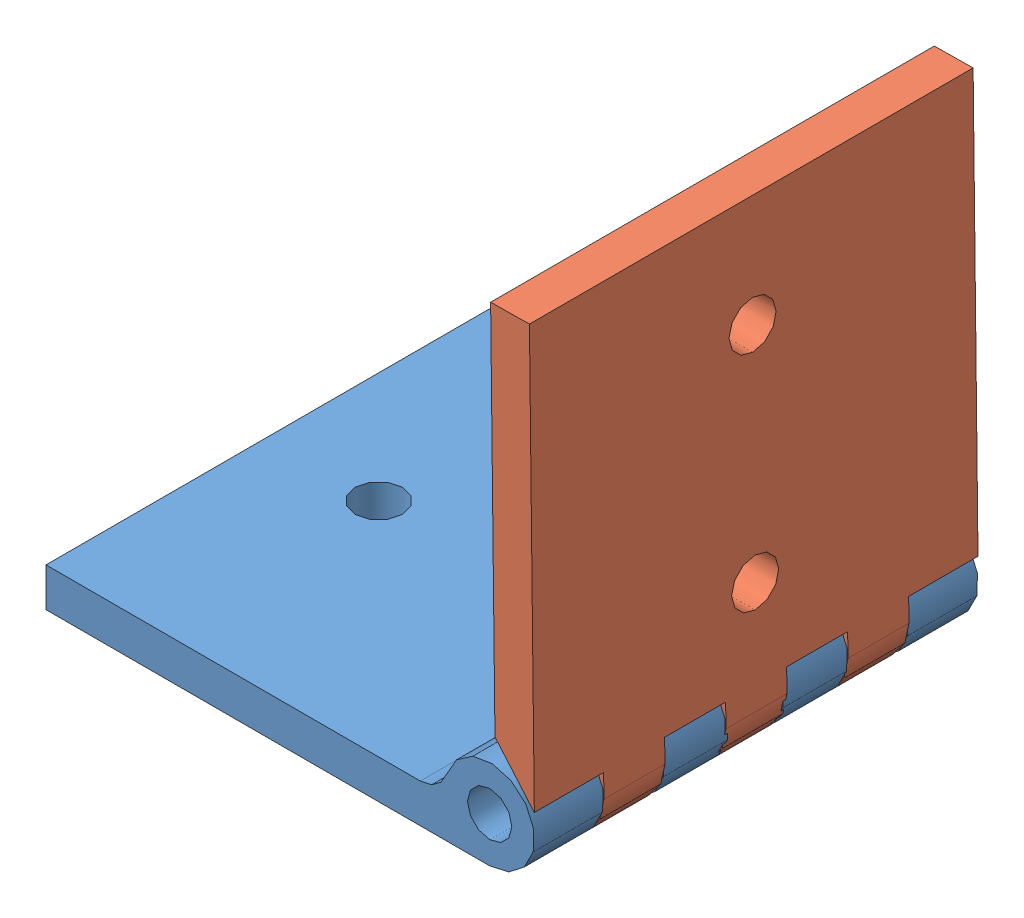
SolidWorks assembly Scharnier 80 x 80.SLDASM, configuration Standard (file format 3400). Lengths in mm.
2 component instances, 2 part files, 2 mates.
Components (placement in the parent):
- Schenkel rechts-1: Schenkel rechts.SLDPRT [Standard] at (37.1239 -9.9448 -40)
- Schenkel links-1: Schenkel links.SLDPRT [Standard] at (45.2234 -1.7507 40) x (0.011617 -0.999933 0) z (0 0 -1)
Mates (geometry in assembly coordinates):
- Deckungsgleich1: coincident anti-aligned: plane of Schenkel rechts-1 through (40.1569 -15.9835 -27.5) normal (0 0 1); plane of Schenkel links-1 through (51.2969 -4.7132 -27.5) normal (0 0 -1)
- Konzentrisch1: concentric anti-aligned: cylinder of Schenkel rechts-1; cylinder of Schenkel links-1
